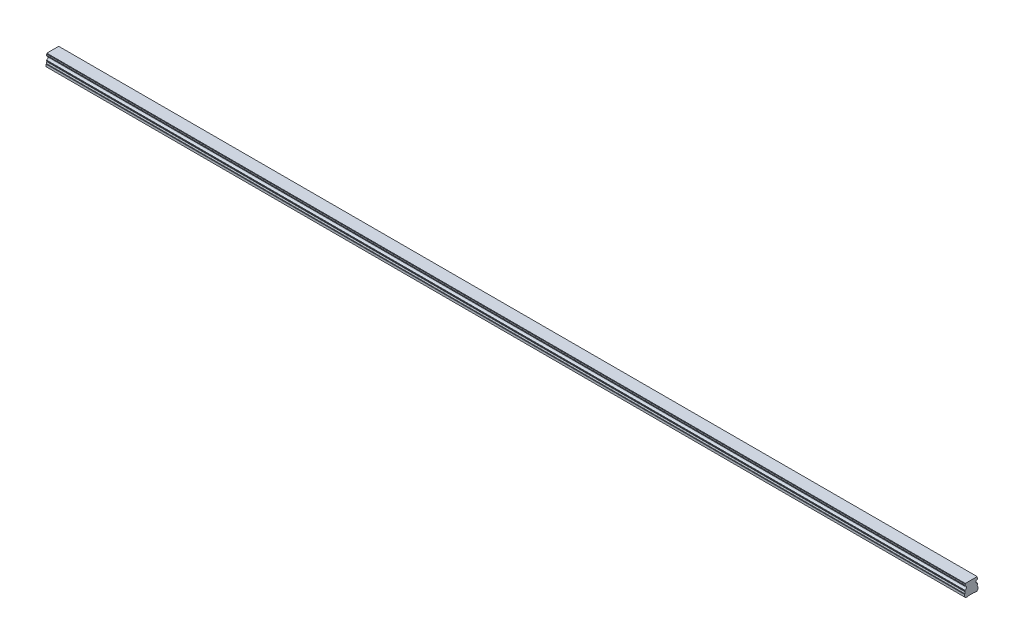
from build123d import *

# Parameters (mm, degrees)
BOSS_EXTRUDE1_DEPTH        = 1020
SKETCH3_R                  = 2.5
SKETCH3_R_2                = 2.1
CUT_EXTRUDE3_DEPTH         = 7
SKETCH3_2_R                = 2.1
CUT_EXTRUDE4_DEPTH         = 9.5
CHAMFER1_SIZE              = 0.4
LPATTERN2_COUNT            = 17
LPATTERN2_PITCH            = 60
CHAMFER1_OF_LPATTERN2_SIZE = 0.4


with BuildPart() as part:
    # Sketch1 → Boss-Extrude1 (new body)
    with BuildSketch(Plane(origin=(0, 0, 0), x_dir=(0, 0, -1), z_dir=(1, 0, 0))):
        with BuildLine():
            Line((6.59, 14), (-6.59, 14))
            Line((-6.59, 14), (-6.59, 13.15))
            Line((-6.59, 13.15), (-6.96, 12.356532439))
            Line((-6.96, 12.356532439), (-6.96, 11.435174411))
            ThreePointArc((-6.96, 11.435174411), (-5.25, 9.5), (-6.96, 7.564825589))
            Line((-6.96, 7.564825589), (-6.96, 6.643467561))
            Line((-6.96, 6.643467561), (-6.59, 5.85))
            Line((-6.59, 5.85), (-7.032116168, 4.2))
            Line((-7.032116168, 4.2), (-7.5, 3.929867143))
            Line((-7.5, 3.929867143), (-7.5, 1.4))
            Line((-7.5, 1.4), (-6.1, 0))
            Line((-6.1, 0), (-3.65, 0))
            Line((-3.65, 0), (-3.25, 0.4))
            Line((-3.25, 0.4), (3.25, 0.4))
            Line((3.25, 0.4), (3.65, 0))
            Line((3.65, 0), (6.1, 0))
            Line((6.1, 0), (7.5, 1.4))
            Line((7.5, 1.4), (7.5, 3.929867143))
            Line((7.5, 3.929867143), (7.032116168, 4.2))
            Line((7.032116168, 4.2), (6.59, 5.85))
            Line((6.59, 5.85), (6.96, 6.643467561))
            Line((6.96, 6.643467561), (6.96, 7.564825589))
            ThreePointArc((6.96, 7.564825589), (5.25, 9.5), (6.96, 11.435174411))
            Line((6.96, 11.435174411), (6.96, 12.356532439))
            Line((6.96, 12.356532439), (6.59, 13.15))
            Line((6.59, 13.15), (6.59, 14))
        make_face()
    extrude(amount=BOSS_EXTRUDE1_DEPTH)

    # Sketch3 → Cut-Extrude3 (cut)
    with BuildSketch(Plane.XZ):
        with Locations(Location((30, 0, 0), (0, 0, 270))):
            Circle(SKETCH3_R)
        with Locations(Location((30, 0, 0), (0, 0, 270))):
            Circle(SKETCH3_R_2, mode=Mode.SUBTRACT)
    cut_extrude3 = extrude(amount=-CUT_EXTRUDE3_DEPTH, mode=Mode.SUBTRACT)

    # Sketch3_2 → Cut-Extrude4 (cut)
    with BuildSketch(Plane.XZ):
        with Locations(Location((30, 0, 0), (0, 0, 270))):
            Circle(SKETCH3_2_R)
    cut_extrude4 = extrude(amount=-CUT_EXTRUDE4_DEPTH, mode=Mode.SUBTRACT)

    # Cut-Extrude5 cone 1 section (on through the dimple's axis) → Cut-Extrude5 (revolve, cut)
    with BuildSketch(Plane(origin=(30, 9.5, 0), x_dir=(0, 0, -1), z_dir=(1, 0, 0))):
        Polygon((0, 0), (2.1, 0), (0, 1.212435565), align=None)
    revolve(axis=Axis((30, 9.5, 0), (0, 1, 0)), mode=Mode.SUBTRACT)

    # Chamfer1
    chamfer1_edges = [part.edges().sort_by_distance(p)[0] for p in [
        (30, 0.4, 2.5),
    ]]
    chamfer(chamfer1_edges, length=CHAMFER1_SIZE)

    # LPattern2: Cut-Extrude3, Cut-Extrude4 ×17
    with Locations(*[(i * LPATTERN2_PITCH, 0, 0) for i in range(1, LPATTERN2_COUNT)]):
        add(cut_extrude3, mode=Mode.SUBTRACT)
        add(cut_extrude4, mode=Mode.SUBTRACT)

    # Chamfer1 of LPattern2
    chamfer1_of_lpattern2_edges = [part.edges().sort_by_distance(p)[0] for p in [
        (90, 0.4, 2.5),
        (150, 0.4, 2.5),
        (210, 0.4, 2.5),
        (270, 0.4, 2.5),
        (330, 0.4, 2.5),
        (390, 0.4, 2.5),
        (450, 0.4, 2.5),
        (510, 0.4, 2.5),
        (570, 0.4, 2.5),
        (630, 0.4, 2.5),
        (690, 0.4, 2.5),
        (750, 0.4, 2.5),
        (810, 0.4, 2.5),
        (870, 0.4, 2.5),
        (930, 0.4, 2.5),
        (990, 0.4, 2.5),
    ]]
    chamfer(chamfer1_of_lpattern2_edges, length=CHAMFER1_OF_LPATTERN2_SIZE)


solid = part.part
